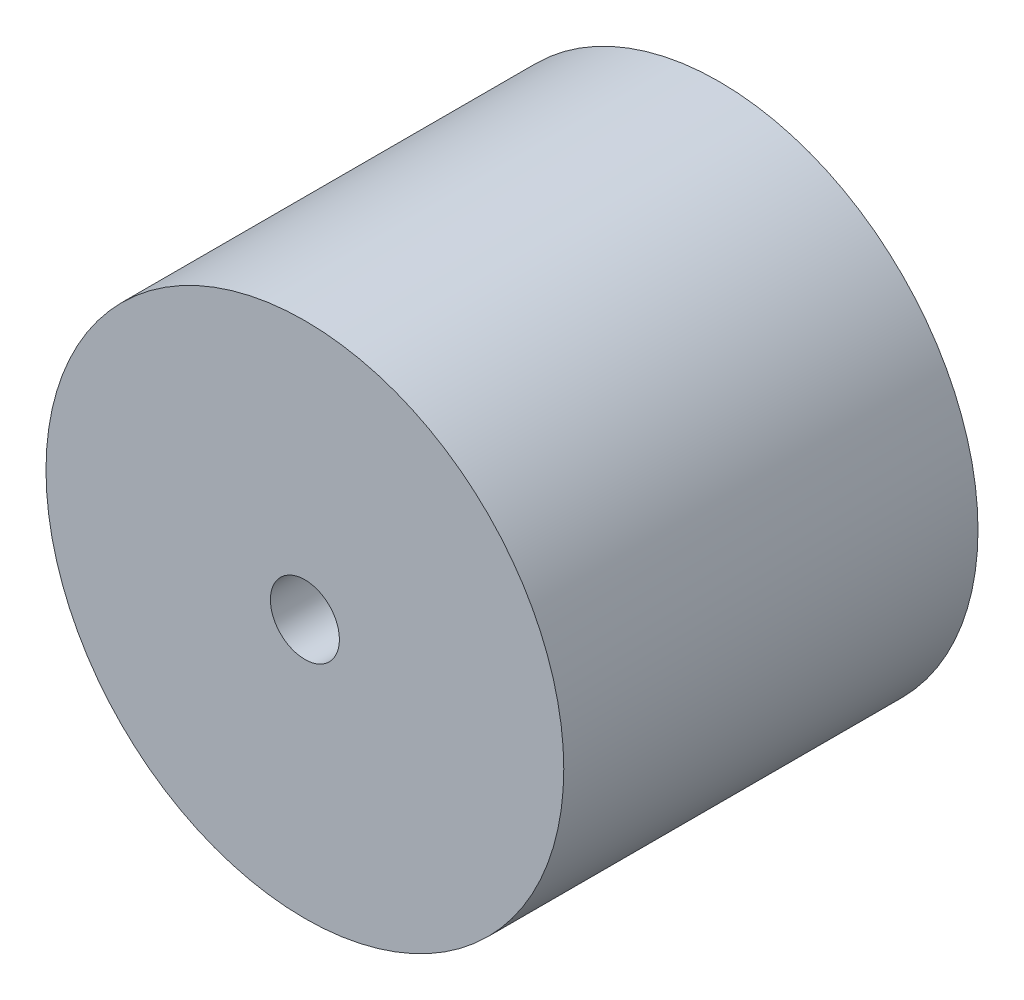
from build123d import *

# Parameters (mm, degrees)
ESQUISSE1_R        = 7.5
ESQUISSE1_R_2      = 1
BOSS_EXTRU_1_DEPTH = 12


with BuildPart() as part:
    # Esquisse1 → Boss.-Extru.1 (new body)
    with BuildSketch(Plane.XY):
        Circle(ESQUISSE1_R)
        Circle(ESQUISSE1_R_2, mode=Mode.SUBTRACT)
    extrude(amount=BOSS_EXTRU_1_DEPTH)


solid = part.part
